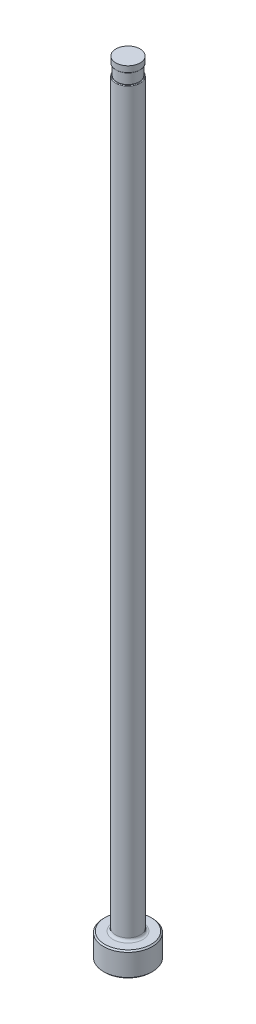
from build123d import *

# Parameters (mm, degrees)
CHAMFER1_SIZE     = 0.254
FILLET1_R         = 0.508
SKETCH2_W         = 0.2032
SKETCH2_H         = 2.032
D_SLOT_DEPTH      = 153.548755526
D_SLOT_DEPTH_BACK = 153.548755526
SKETCH5_W         = 0.01905
SKETCH5_H         = 1.27
FILLET2_R         = 0.127


with BuildPart() as part:
    # Sketch1 → Revolve1 (revolve)
    with BuildSketch(Plane.XY, mode=Mode.PRIVATE) as revolve1_sk:
        Polygon((0, 0), (-4.7625, 0), (-4.7625, 4.7498), (-2.38125, 4.7498), (-2.38125, 152.4), (0, 152.4), align=None)
    revolve(revolve1_sk.sketch.rotate(Axis((0, 259.958771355, 0), (0, -1, 0)), 270), axis=Axis((0, 259.958771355, 0), (0, -1, 0)))

    # Chamfer1
    chamfer1_edges = [part.edges().sort_by_distance(p)[0] for p in [
        (0, 4.7498, -4.7625),
        (0, 0, -4.7625),
    ]]
    chamfer(chamfer1_edges, length=CHAMFER1_SIZE)

    # Fillet1
    fillet1_edges = [part.edges().sort_by_distance(p)[0] for p in [
        (0, 4.7498, -2.38125),
    ]]
    fillet(fillet1_edges, radius=FILLET1_R)

    # Sketch2 → Vent Relief (revolve, cut)
    with BuildSketch(Plane.XY, mode=Mode.PRIVATE) as vent_relief_sk:
        with Locations((-2.27965, 150.114)):
            Rectangle(SKETCH2_W, SKETCH2_H)
    revolve(vent_relief_sk.sketch.rotate(Axis((0, 153.448281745, 0), (0, -1, 0)), 270), axis=Axis((0, 153.448281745, 0), (0, -1, 0)), mode=Mode.SUBTRACT)

    # Sketch3 → D-Slot (cut, two sides: drawn at the far end of the back side and taken through both)
    with BuildSketch(Plane.XY.offset(-D_SLOT_DEPTH_BACK)):
        with BuildLine():
            Line((-2.17805, 150.114), (-2.17805, 86.614))
            ThreePointArc((-2.17805, 86.614), (-2.229263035, 86.046038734), (-2.38125, 85.4964))
            Line((-2.38125, 85.4964), (-2.38125, 150.114))
            Line((-2.38125, 150.114), (-2.17805, 150.114))
        make_face()
    extrude(amount=D_SLOT_DEPTH + D_SLOT_DEPTH_BACK, mode=Mode.SUBTRACT)

    # Sketch5 → Vent Diameter (revolve, cut)
    with BuildSketch(Plane.XY, mode=Mode.PRIVATE) as vent_diameter_sk:
        with Locations((-2.371725, 151.765)):
            Rectangle(SKETCH5_W, SKETCH5_H)
    revolve(vent_diameter_sk.sketch.rotate(Axis((0, 152.687735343, 0), (0, -1, 0)), 90), axis=Axis((0, 152.687735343, 0), (0, -1, 0)), mode=Mode.SUBTRACT)

    # Fillet2
    fillet2_edges = [part.edges().sort_by_distance(p)[0] for p in [
        (1.995289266, 149.098, -1.299681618),
        (0, 151.13, 2.3622),
    ]]
    fillet(fillet2_edges, radius=FILLET2_R)


solid = part.part
